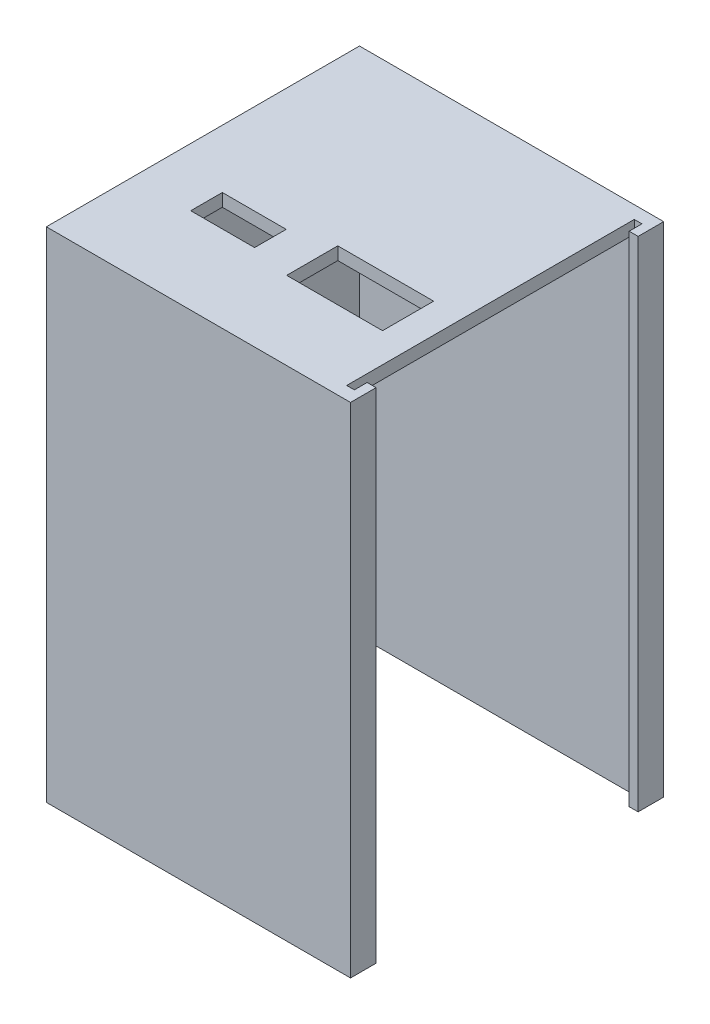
ISO-10303-21;
HEADER;
FILE_DESCRIPTION(('STEP AP214'),'2;1');
FILE_NAME('part.step','',(''),(''),'','','');
FILE_SCHEMA(('AUTOMOTIVE_DESIGN { 1 0 10303 214 1 1 1 1 }'));
ENDSEC;
DATA;
#1=APPLICATION_CONTEXT('core data for automotive mechanical design processes');
#2=APPLICATION_PROTOCOL_DEFINITION('international standard','automotive_design',2000,#1);
#3=PRODUCT_CONTEXT('',#1,'mechanical');
#4=PRODUCT('Part','Part','',(#3));
#5=PRODUCT_RELATED_PRODUCT_CATEGORY('part','',(#4));
#6=PRODUCT_DEFINITION_FORMATION('','',#4);
#7=PRODUCT_DEFINITION_CONTEXT('part definition',#1,'design');
#8=PRODUCT_DEFINITION('design','',#6,#7);
#9=PRODUCT_DEFINITION_SHAPE('','',#8);
#10=(LENGTH_UNIT() NAMED_UNIT(*) SI_UNIT(.MILLI.,.METRE.));
#11=(NAMED_UNIT(*) PLANE_ANGLE_UNIT() SI_UNIT($,.RADIAN.));
#12=(NAMED_UNIT(*) SI_UNIT($,.STERADIAN.) SOLID_ANGLE_UNIT());
#13=UNCERTAINTY_MEASURE_WITH_UNIT(LENGTH_MEASURE(1.E-05),#10,'distance_accuracy_value','');
#14=(GEOMETRIC_REPRESENTATION_CONTEXT(3) GLOBAL_UNCERTAINTY_ASSIGNED_CONTEXT((#13)) GLOBAL_UNIT_ASSIGNED_CONTEXT((#10,
#11,#12)) REPRESENTATION_CONTEXT('',''));
#15=CARTESIAN_POINT('',(0.,0.,0.));
#16=DIRECTION('',(0.,0.,1.));
#17=DIRECTION('',(1.,0.,0.));
#18=AXIS2_PLACEMENT_3D('',#15,#16,#17);
#19=CARTESIAN_POINT('',(22.7,-78.,-24.5));
#20=DIRECTION('',(1.,0.,0.));
#21=DIRECTION('',(0.,0.,-1.));
#22=AXIS2_PLACEMENT_3D('',#19,#20,#21);
#23=PLANE('',#22);
#24=DIRECTION('',(0.,1.,0.));
#25=VECTOR('',#24,1.);
#26=CARTESIAN_POINT('',(22.7,-78.,-24.5));
#27=LINE('',#26,#25);
#28=CARTESIAN_POINT('',(22.7,-78.,-24.5));
#29=VERTEX_POINT('',#28);
#30=CARTESIAN_POINT('',(22.7,-77.9884535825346,-24.5));
#31=VERTEX_POINT('',#30);
#32=EDGE_CURVE('E56',#29,#31,#27,.T.);
#33=ORIENTED_EDGE('',*,*,#32,.T.);
#34=DIRECTION('',(0.,0.,-1.));
#35=VECTOR('',#34,1.);
#36=CARTESIAN_POINT('',(22.7,-77.9884535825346,-24.5));
#37=LINE('',#36,#35);
#38=CARTESIAN_POINT('',(22.7,-77.9884535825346,-22.5));
#39=VERTEX_POINT('',#38);
#40=EDGE_CURVE('E51',#39,#31,#37,.T.);
#41=ORIENTED_EDGE('',*,*,#40,.F.);
#42=DIRECTION('',(0.,1.,0.));
#43=VECTOR('',#42,1.);
#44=CARTESIAN_POINT('',(22.7,-78.,-22.5));
#45=LINE('',#44,#43);
#46=CARTESIAN_POINT('',(22.7,-78.,-22.5));
#47=VERTEX_POINT('',#46);
#48=EDGE_CURVE('E293',#47,#39,#45,.T.);
#49=ORIENTED_EDGE('',*,*,#48,.F.);
#50=DIRECTION('',(0.,0.,-1.));
#51=VECTOR('',#50,1.);
#52=CARTESIAN_POINT('',(22.7,-78.,-24.5));
#53=LINE('',#52,#51);
#54=EDGE_CURVE('E272',#47,#29,#53,.T.);
#55=ORIENTED_EDGE('',*,*,#54,.T.);
#56=EDGE_LOOP('',(#33,#41,#49,#55));
#57=FACE_BOUND('',#56,.T.);
#58=ADVANCED_FACE('F35',(#57),#23,.T.);
#59=CARTESIAN_POINT('',(21.5,-2.,-22.5));
#60=DIRECTION('',(1.,0.,0.));
#61=DIRECTION('',(0.,0.,-1.));
#62=AXIS2_PLACEMENT_3D('',#59,#60,#61);
#63=PLANE('',#62);
#64=DIRECTION('',(0.,0.,-1.));
#65=VECTOR('',#64,1.);
#66=CARTESIAN_POINT('',(21.5,0.,-22.5));
#67=LINE('',#66,#65);
#68=CARTESIAN_POINT('',(21.5,0.,22.5));
#69=VERTEX_POINT('',#68);
#70=CARTESIAN_POINT('',(21.5,0.,-22.5));
#71=VERTEX_POINT('',#70);
#72=EDGE_CURVE('E361',#69,#71,#67,.T.);
#73=ORIENTED_EDGE('',*,*,#72,.F.);
#74=DIRECTION('',(0.,1.,0.));
#75=VECTOR('',#74,1.);
#76=CARTESIAN_POINT('',(21.5,-2.,22.5));
#77=LINE('',#76,#75);
#78=CARTESIAN_POINT('',(21.5,-2.,22.5));
#79=VERTEX_POINT('',#78);
#80=EDGE_CURVE('E11',#79,#69,#77,.T.);
#81=ORIENTED_EDGE('',*,*,#80,.F.);
#82=DIRECTION('',(0.,0.,-1.));
#83=VECTOR('',#82,1.);
#84=CARTESIAN_POINT('',(21.5,-2.,-22.5));
#85=LINE('',#84,#83);
#86=CARTESIAN_POINT('',(21.5,-2.,-22.5));
#87=VERTEX_POINT('',#86);
#88=EDGE_CURVE('E368',#79,#87,#85,.T.);
#89=ORIENTED_EDGE('',*,*,#88,.T.);
#90=DIRECTION('',(0.,1.,0.));
#91=VECTOR('',#90,1.);
#92=CARTESIAN_POINT('',(21.5,-2.,-22.5));
#93=LINE('',#92,#91);
#94=EDGE_CURVE('E44',#87,#71,#93,.T.);
#95=ORIENTED_EDGE('',*,*,#94,.T.);
#96=EDGE_LOOP('',(#73,#81,#89,#95));
#97=FACE_BOUND('',#96,.T.);
#98=ADVANCED_FACE('F37',(#97),#63,.T.);
#99=CARTESIAN_POINT('',(0.,-2.,0.));
#100=DIRECTION('',(0.,1.,0.));
#101=DIRECTION('',(0.,0.,1.));
#102=AXIS2_PLACEMENT_3D('',#99,#100,#101);
#103=PLANE('',#102);
#104=DIRECTION('',(0.,0.,-1.));
#105=VECTOR('',#104,1.);
#106=CARTESIAN_POINT('',(-14.3796285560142,-2.,6.08096368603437));
#107=LINE('',#106,#105);
#108=CARTESIAN_POINT('',(-14.3796285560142,-2.,11.0244015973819));
#109=VERTEX_POINT('',#108);
#110=CARTESIAN_POINT('',(-14.3796285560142,-2.,6.08096368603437));
#111=VERTEX_POINT('',#110);
#112=EDGE_CURVE('E301',#109,#111,#107,.T.);
#113=ORIENTED_EDGE('',*,*,#112,.F.);
#114=DIRECTION('',(-1.,0.,0.));
#115=VECTOR('',#114,1.);
#116=CARTESIAN_POINT('',(-4.38727623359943,-2.,11.0244015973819));
#117=LINE('',#116,#115);
#118=CARTESIAN_POINT('',(-4.38727623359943,-2.,11.0244015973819));
#119=VERTEX_POINT('',#118);
#120=EDGE_CURVE('E308',#119,#109,#117,.T.);
#121=ORIENTED_EDGE('',*,*,#120,.F.);
#122=DIRECTION('',(0.,0.,1.));
#123=VECTOR('',#122,1.);
#124=CARTESIAN_POINT('',(-4.38727623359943,-2.,10.4719816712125));
#125=LINE('',#124,#123);
#126=CARTESIAN_POINT('',(-4.38727623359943,-2.,6.08096368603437));
#127=VERTEX_POINT('',#126);
#128=EDGE_CURVE('E323',#127,#119,#125,.T.);
#129=ORIENTED_EDGE('',*,*,#128,.F.);
#130=DIRECTION('',(1.,0.,0.));
#131=VECTOR('',#130,1.);
#132=CARTESIAN_POINT('',(-4.38727623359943,-2.,6.08096368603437));
#133=LINE('',#132,#131);
#134=EDGE_CURVE('E320',#111,#127,#133,.T.);
#135=ORIENTED_EDGE('',*,*,#134,.F.);
#136=EDGE_LOOP('',(#113,#121,#129,#135));
#137=FACE_BOUND('',#136,.T.);
#138=DIRECTION('',(1.,0.,0.));
#139=VECTOR('',#138,1.);
#140=CARTESIAN_POINT('',(16.8834523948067,-2.,4.27647267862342));
#141=LINE('',#140,#139);
#142=CARTESIAN_POINT('',(1.88345239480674,-2.,4.27647267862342));
#143=VERTEX_POINT('',#142);
#144=CARTESIAN_POINT('',(16.8834523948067,-2.,4.27647267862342));
#145=VERTEX_POINT('',#144);
#146=EDGE_CURVE('E351',#143,#145,#141,.T.);
#147=ORIENTED_EDGE('',*,*,#146,.F.);
#148=DIRECTION('',(0.,0.,-1.));
#149=VECTOR('',#148,1.);
#150=CARTESIAN_POINT('',(1.88345239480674,-2.,4.27647267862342));
#151=LINE('',#150,#149);
#152=CARTESIAN_POINT('',(1.88345239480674,-2.,12.2764726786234));
#153=VERTEX_POINT('',#152);
#154=EDGE_CURVE('E330',#153,#143,#151,.T.);
#155=ORIENTED_EDGE('',*,*,#154,.F.);
#156=DIRECTION('',(-1.,0.,0.));
#157=VECTOR('',#156,1.);
#158=CARTESIAN_POINT('',(16.8834523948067,-2.,12.2764726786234));
#159=LINE('',#158,#157);
#160=CARTESIAN_POINT('',(16.8834523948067,-2.,12.2764726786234));
#161=VERTEX_POINT('',#160);
#162=EDGE_CURVE('E340',#161,#153,#159,.T.);
#163=ORIENTED_EDGE('',*,*,#162,.F.);
#164=DIRECTION('',(0.,0.,1.));
#165=VECTOR('',#164,1.);
#166=CARTESIAN_POINT('',(16.8834523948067,-2.,4.27647267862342));
#167=LINE('',#166,#165);
#168=EDGE_CURVE('E354',#145,#161,#167,.T.);
#169=ORIENTED_EDGE('',*,*,#168,.F.);
#170=EDGE_LOOP('',(#147,#155,#163,#169));
#171=FACE_BOUND('',#170,.T.);
#172=ORIENTED_EDGE('',*,*,#88,.F.);
#173=DIRECTION('',(1.,0.,0.));
#174=VECTOR('',#173,1.);
#175=CARTESIAN_POINT('',(-21.5,-2.,22.5));
#176=LINE('',#175,#174);
#177=CARTESIAN_POINT('',(-21.5,-2.,22.5));
#178=VERTEX_POINT('',#177);
#179=EDGE_CURVE('E380',#178,#79,#176,.T.);
#180=ORIENTED_EDGE('',*,*,#179,.F.);
#181=DIRECTION('',(0.,0.,1.));
#182=VECTOR('',#181,1.);
#183=CARTESIAN_POINT('',(-21.5,-2.,-22.5));
#184=LINE('',#183,#182);
#185=CARTESIAN_POINT('',(-21.5,-2.,-22.5));
#186=VERTEX_POINT('',#185);
#187=EDGE_CURVE('E376',#186,#178,#184,.T.);
#188=ORIENTED_EDGE('',*,*,#187,.F.);
#189=DIRECTION('',(-1.,0.,0.));
#190=VECTOR('',#189,1.);
#191=CARTESIAN_POINT('',(-21.5,-2.,-22.5));
#192=LINE('',#191,#190);
#193=EDGE_CURVE('E371',#87,#186,#192,.T.);
#194=ORIENTED_EDGE('',*,*,#193,.F.);
#195=EDGE_LOOP('',(#172,#180,#188,#194));
#196=FACE_BOUND('',#195,.T.);
#197=ADVANCED_FACE('F400',(#137,#171,#196),#103,.F.);
#198=CARTESIAN_POINT('',(0.,0.,0.));
#199=DIRECTION('',(0.,1.,0.));
#200=DIRECTION('',(0.,0.,1.));
#201=AXIS2_PLACEMENT_3D('',#198,#199,#200);
#202=PLANE('',#201);
#203=DIRECTION('',(-1.,0.,0.));
#204=VECTOR('',#203,1.);
#205=CARTESIAN_POINT('',(-4.38727623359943,0.,11.0244015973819));
#206=LINE('',#205,#204);
#207=CARTESIAN_POINT('',(-4.38727623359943,0.,11.0244015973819));
#208=VERTEX_POINT('',#207);
#209=CARTESIAN_POINT('',(-14.3796285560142,0.,11.0244015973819));
#210=VERTEX_POINT('',#209);
#211=EDGE_CURVE('E314',#208,#210,#206,.T.);
#212=ORIENTED_EDGE('',*,*,#211,.T.);
#213=DIRECTION('',(0.,0.,-1.));
#214=VECTOR('',#213,1.);
#215=CARTESIAN_POINT('',(-14.3796285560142,0.,11.0244015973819));
#216=LINE('',#215,#214);
#217=CARTESIAN_POINT('',(-14.3796285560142,0.,6.08096368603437));
#218=VERTEX_POINT('',#217);
#219=EDGE_CURVE('E304',#210,#218,#216,.T.);
#220=ORIENTED_EDGE('',*,*,#219,.T.);
#221=DIRECTION('',(1.,0.,0.));
#222=VECTOR('',#221,1.);
#223=CARTESIAN_POINT('',(-4.38727623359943,0.,6.08096368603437));
#224=LINE('',#223,#222);
#225=CARTESIAN_POINT('',(-4.38727623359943,0.,6.08096368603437));
#226=VERTEX_POINT('',#225);
#227=EDGE_CURVE('E307',#218,#226,#224,.T.);
#228=ORIENTED_EDGE('',*,*,#227,.T.);
#229=DIRECTION('',(0.,0.,1.));
#230=VECTOR('',#229,1.);
#231=CARTESIAN_POINT('',(-4.38727623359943,0.,6.08096368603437));
#232=LINE('',#231,#230);
#233=EDGE_CURVE('E311',#226,#208,#232,.T.);
#234=ORIENTED_EDGE('',*,*,#233,.T.);
#235=EDGE_LOOP('',(#212,#220,#228,#234));
#236=FACE_BOUND('',#235,.T.);
#237=DIRECTION('',(0.,0.,-1.));
#238=VECTOR('',#237,1.);
#239=CARTESIAN_POINT('',(1.88345239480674,0.,4.27647267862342));
#240=LINE('',#239,#238);
#241=CARTESIAN_POINT('',(1.88345239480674,0.,12.2764726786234));
#242=VERTEX_POINT('',#241);
#243=CARTESIAN_POINT('',(1.88345239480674,0.,4.27647267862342));
#244=VERTEX_POINT('',#243);
#245=EDGE_CURVE('E336',#242,#244,#240,.T.);
#246=ORIENTED_EDGE('',*,*,#245,.T.);
#247=DIRECTION('',(1.,0.,0.));
#248=VECTOR('',#247,1.);
#249=CARTESIAN_POINT('',(16.8834523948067,0.,4.27647267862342));
#250=LINE('',#249,#248);
#251=CARTESIAN_POINT('',(16.8834523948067,0.,4.27647267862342));
#252=VERTEX_POINT('',#251);
#253=EDGE_CURVE('E339',#244,#252,#250,.T.);
#254=ORIENTED_EDGE('',*,*,#253,.T.);
#255=DIRECTION('',(0.,0.,1.));
#256=VECTOR('',#255,1.);
#257=CARTESIAN_POINT('',(16.8834523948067,0.,4.27647267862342));
#258=LINE('',#257,#256);
#259=CARTESIAN_POINT('',(16.8834523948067,0.,12.2764726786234));
#260=VERTEX_POINT('',#259);
#261=EDGE_CURVE('E343',#252,#260,#258,.T.);
#262=ORIENTED_EDGE('',*,*,#261,.T.);
#263=DIRECTION('',(-1.,0.,0.));
#264=VECTOR('',#263,1.);
#265=CARTESIAN_POINT('',(16.8834523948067,0.,12.2764726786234));
#266=LINE('',#265,#264);
#267=EDGE_CURVE('E346',#260,#242,#266,.T.);
#268=ORIENTED_EDGE('',*,*,#267,.T.);
#269=EDGE_LOOP('',(#246,#254,#262,#268));
#270=FACE_BOUND('',#269,.T.);
#271=ORIENTED_EDGE('',*,*,#72,.T.);
#272=DIRECTION('',(1.,0.,0.));
#273=VECTOR('',#272,1.);
#274=CARTESIAN_POINT('',(-23.5,0.,-22.5));
#275=LINE('',#274,#273);
#276=CARTESIAN_POINT('',(22.7,0.,-22.5));
#277=VERTEX_POINT('',#276);
#278=EDGE_CURVE('E275',#71,#277,#275,.T.);
#279=ORIENTED_EDGE('',*,*,#278,.T.);
#280=DIRECTION('',(0.,0.,1.));
#281=VECTOR('',#280,1.);
#282=CARTESIAN_POINT('',(22.7,0.,-24.5));
#283=LINE('',#282,#281);
#284=CARTESIAN_POINT('',(22.7,0.,-20.5));
#285=VERTEX_POINT('',#284);
#286=EDGE_CURVE('E235',#277,#285,#283,.T.);
#287=ORIENTED_EDGE('',*,*,#286,.T.);
#288=DIRECTION('',(-1.,0.,0.));
#289=VECTOR('',#288,1.);
#290=CARTESIAN_POINT('',(24.1,0.,-20.5));
#291=LINE('',#290,#289);
#292=CARTESIAN_POINT('',(24.1,0.,-20.5));
#293=VERTEX_POINT('',#292);
#294=EDGE_CURVE('E257',#293,#285,#291,.T.);
#295=ORIENTED_EDGE('',*,*,#294,.F.);
#296=DIRECTION('',(0.,0.,1.));
#297=VECTOR('',#296,1.);
#298=CARTESIAN_POINT('',(24.1,0.,-24.5));
#299=LINE('',#298,#297);
#300=CARTESIAN_POINT('',(24.1,0.,-24.5));
#301=VERTEX_POINT('',#300);
#302=EDGE_CURVE('E239',#301,#293,#299,.T.);
#303=ORIENTED_EDGE('',*,*,#302,.F.);
#304=DIRECTION('',(-1.,0.,0.));
#305=VECTOR('',#304,1.);
#306=CARTESIAN_POINT('',(-23.5,0.,-24.5));
#307=LINE('',#306,#305);
#308=CARTESIAN_POINT('',(-23.5,0.,-24.5));
#309=VERTEX_POINT('',#308);
#310=EDGE_CURVE('E281',#301,#309,#307,.T.);
#311=ORIENTED_EDGE('',*,*,#310,.T.);
#312=DIRECTION('',(0.,0.,1.));
#313=VECTOR('',#312,1.);
#314=CARTESIAN_POINT('',(-23.5,0.,22.5));
#315=LINE('',#314,#313);
#316=CARTESIAN_POINT('',(-23.5,0.,24.5));
#317=VERTEX_POINT('',#316);
#318=EDGE_CURVE('E291',#309,#317,#315,.T.);
#319=ORIENTED_EDGE('',*,*,#318,.T.);
#320=DIRECTION('',(1.,0.,0.));
#321=VECTOR('',#320,1.);
#322=CARTESIAN_POINT('',(22.7,0.,24.5));
#323=LINE('',#322,#321);
#324=CARTESIAN_POINT('',(24.1,0.,24.5));
#325=VERTEX_POINT('',#324);
#326=EDGE_CURVE('E270',#317,#325,#323,.T.);
#327=ORIENTED_EDGE('',*,*,#326,.T.);
#328=DIRECTION('',(0.,0.,1.));
#329=VECTOR('',#328,1.);
#330=CARTESIAN_POINT('',(24.1,0.,24.5));
#331=LINE('',#330,#329);
#332=CARTESIAN_POINT('',(24.1,0.,20.5));
#333=VERTEX_POINT('',#332);
#334=EDGE_CURVE('E219',#333,#325,#331,.T.);
#335=ORIENTED_EDGE('',*,*,#334,.F.);
#336=DIRECTION('',(-1.,0.,0.));
#337=VECTOR('',#336,1.);
#338=CARTESIAN_POINT('',(24.1,0.,20.5));
#339=LINE('',#338,#337);
#340=CARTESIAN_POINT('',(22.7,0.,20.5));
#341=VERTEX_POINT('',#340);
#342=EDGE_CURVE('E228',#333,#341,#339,.T.);
#343=ORIENTED_EDGE('',*,*,#342,.T.);
#344=DIRECTION('',(0.,0.,1.));
#345=VECTOR('',#344,1.);
#346=CARTESIAN_POINT('',(22.7,0.,24.5));
#347=LINE('',#346,#345);
#348=CARTESIAN_POINT('',(22.7,0.,22.5));
#349=VERTEX_POINT('',#348);
#350=EDGE_CURVE('E220',#341,#349,#347,.T.);
#351=ORIENTED_EDGE('',*,*,#350,.T.);
#352=DIRECTION('',(-1.,0.,0.));
#353=VECTOR('',#352,1.);
#354=CARTESIAN_POINT('',(22.7,0.,22.5));
#355=LINE('',#354,#353);
#356=EDGE_CURVE('E263',#349,#69,#355,.T.);
#357=ORIENTED_EDGE('',*,*,#356,.T.);
#358=EDGE_LOOP('',(#271,#279,#287,#295,#303,#311,#319,#327,#335,#343,#351,#357));
#359=FACE_BOUND('',#358,.T.);
#360=ADVANCED_FACE('F424',(#236,#270,#359),#202,.T.);
#361=CARTESIAN_POINT('',(1.88345239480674,0.,4.27647267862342));
#362=DIRECTION('',(-1.,0.,0.));
#363=DIRECTION('',(0.,0.,1.));
#364=AXIS2_PLACEMENT_3D('',#361,#362,#363);
#365=PLANE('',#364);
#366=ORIENTED_EDGE('',*,*,#154,.T.);
#367=DIRECTION('',(0.,-1.,0.));
#368=VECTOR('',#367,1.);
#369=CARTESIAN_POINT('',(1.88345239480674,0.,4.27647267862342));
#370=LINE('',#369,#368);
#371=EDGE_CURVE('E349',#244,#143,#370,.T.);
#372=ORIENTED_EDGE('',*,*,#371,.F.);
#373=ORIENTED_EDGE('',*,*,#245,.F.);
#374=DIRECTION('',(0.,-1.,0.));
#375=VECTOR('',#374,1.);
#376=CARTESIAN_POINT('',(1.88345239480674,0.,12.2764726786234));
#377=LINE('',#376,#375);
#378=EDGE_CURVE('E359',#242,#153,#377,.T.);
#379=ORIENTED_EDGE('',*,*,#378,.T.);
#380=EDGE_LOOP('',(#366,#372,#373,#379));
#381=FACE_BOUND('',#380,.T.);
#382=ADVANCED_FACE('F489',(#381),#365,.F.);
#383=CARTESIAN_POINT('',(16.8834523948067,0.,12.2764726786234));
#384=DIRECTION('',(0.,0.,1.));
#385=DIRECTION('',(1.,0.,0.));
#386=AXIS2_PLACEMENT_3D('',#383,#384,#385);
#387=PLANE('',#386);
#388=ORIENTED_EDGE('',*,*,#162,.T.);
#389=ORIENTED_EDGE('',*,*,#378,.F.);
#390=ORIENTED_EDGE('',*,*,#267,.F.);
#391=DIRECTION('',(0.,-1.,0.));
#392=VECTOR('',#391,1.);
#393=CARTESIAN_POINT('',(16.8834523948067,0.,12.2764726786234));
#394=LINE('',#393,#392);
#395=EDGE_CURVE('E362',#260,#161,#394,.T.);
#396=ORIENTED_EDGE('',*,*,#395,.T.);
#397=EDGE_LOOP('',(#388,#389,#390,#396));
#398=FACE_BOUND('',#397,.T.);
#399=ADVANCED_FACE('F485',(#398),#387,.F.);
#400=CARTESIAN_POINT('',(16.8834523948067,0.,4.27647267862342));
#401=DIRECTION('',(1.,0.,0.));
#402=DIRECTION('',(0.,0.,-1.));
#403=AXIS2_PLACEMENT_3D('',#400,#401,#402);
#404=PLANE('',#403);
#405=ORIENTED_EDGE('',*,*,#168,.T.);
#406=ORIENTED_EDGE('',*,*,#395,.F.);
#407=ORIENTED_EDGE('',*,*,#261,.F.);
#408=DIRECTION('',(0.,-1.,0.));
#409=VECTOR('',#408,1.);
#410=CARTESIAN_POINT('',(16.8834523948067,0.,4.27647267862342));
#411=LINE('',#410,#409);
#412=EDGE_CURVE('E364',#252,#145,#411,.T.);
#413=ORIENTED_EDGE('',*,*,#412,.T.);
#414=EDGE_LOOP('',(#405,#406,#407,#413));
#415=FACE_BOUND('',#414,.T.);
#416=ADVANCED_FACE('F488',(#415),#404,.F.);
#417=CARTESIAN_POINT('',(16.8834523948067,0.,4.27647267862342));
#418=DIRECTION('',(0.,0.,-1.));
#419=DIRECTION('',(-1.,0.,0.));
#420=AXIS2_PLACEMENT_3D('',#417,#418,#419);
#421=PLANE('',#420);
#422=ORIENTED_EDGE('',*,*,#146,.T.);
#423=ORIENTED_EDGE('',*,*,#412,.F.);
#424=ORIENTED_EDGE('',*,*,#253,.F.);
#425=ORIENTED_EDGE('',*,*,#371,.T.);
#426=EDGE_LOOP('',(#422,#423,#424,#425));
#427=FACE_BOUND('',#426,.T.);
#428=ADVANCED_FACE('F473',(#427),#421,.F.);
#429=CARTESIAN_POINT('',(-4.38727623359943,0.,11.0244015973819));
#430=DIRECTION('',(0.,0.,1.));
#431=DIRECTION('',(1.,0.,0.));
#432=AXIS2_PLACEMENT_3D('',#429,#430,#431);
#433=PLANE('',#432);
#434=ORIENTED_EDGE('',*,*,#120,.T.);
#435=DIRECTION('',(0.,-1.,0.));
#436=VECTOR('',#435,1.);
#437=CARTESIAN_POINT('',(-14.3796285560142,0.,11.0244015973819));
#438=LINE('',#437,#436);
#439=EDGE_CURVE('E327',#210,#109,#438,.T.);
#440=ORIENTED_EDGE('',*,*,#439,.F.);
#441=ORIENTED_EDGE('',*,*,#211,.F.);
#442=DIRECTION('',(0.,-1.,0.));
#443=VECTOR('',#442,1.);
#444=CARTESIAN_POINT('',(-4.38727623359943,0.,11.0244015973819));
#445=LINE('',#444,#443);
#446=EDGE_CURVE('E331',#208,#119,#445,.T.);
#447=ORIENTED_EDGE('',*,*,#446,.T.);
#448=EDGE_LOOP('',(#434,#440,#441,#447));
#449=FACE_BOUND('',#448,.T.);
#450=ADVANCED_FACE('F469',(#449),#433,.F.);
#451=CARTESIAN_POINT('',(-4.38727623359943,0.,10.4719816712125));
#452=DIRECTION('',(1.,0.,0.));
#453=DIRECTION('',(0.,0.,-1.));
#454=AXIS2_PLACEMENT_3D('',#451,#452,#453);
#455=PLANE('',#454);
#456=ORIENTED_EDGE('',*,*,#128,.T.);
#457=ORIENTED_EDGE('',*,*,#446,.F.);
#458=ORIENTED_EDGE('',*,*,#233,.F.);
#459=DIRECTION('',(0.,-1.,0.));
#460=VECTOR('',#459,1.);
#461=CARTESIAN_POINT('',(-4.38727623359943,0.,6.08096368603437));
#462=LINE('',#461,#460);
#463=EDGE_CURVE('E333',#226,#127,#462,.T.);
#464=ORIENTED_EDGE('',*,*,#463,.T.);
#465=EDGE_LOOP('',(#456,#457,#458,#464));
#466=FACE_BOUND('',#465,.T.);
#467=ADVANCED_FACE('F472',(#466),#455,.F.);
#468=CARTESIAN_POINT('',(-4.38727623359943,0.,6.08096368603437));
#469=DIRECTION('',(0.,0.,-1.));
#470=DIRECTION('',(-1.,0.,0.));
#471=AXIS2_PLACEMENT_3D('',#468,#469,#470);
#472=PLANE('',#471);
#473=ORIENTED_EDGE('',*,*,#134,.T.);
#474=ORIENTED_EDGE('',*,*,#463,.F.);
#475=ORIENTED_EDGE('',*,*,#227,.F.);
#476=DIRECTION('',(0.,-1.,0.));
#477=VECTOR('',#476,1.);
#478=CARTESIAN_POINT('',(-14.3796285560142,0.,6.08096368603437));
#479=LINE('',#478,#477);
#480=EDGE_CURVE('E317',#218,#111,#479,.T.);
#481=ORIENTED_EDGE('',*,*,#480,.T.);
#482=EDGE_LOOP('',(#473,#474,#475,#481));
#483=FACE_BOUND('',#482,.T.);
#484=ADVANCED_FACE('F477',(#483),#472,.F.);
#485=CARTESIAN_POINT('',(-14.3796285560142,0.,6.08096368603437));
#486=DIRECTION('',(-1.,0.,0.));
#487=DIRECTION('',(0.,0.,1.));
#488=AXIS2_PLACEMENT_3D('',#485,#486,#487);
#489=PLANE('',#488);
#490=ORIENTED_EDGE('',*,*,#112,.T.);
#491=ORIENTED_EDGE('',*,*,#480,.F.);
#492=ORIENTED_EDGE('',*,*,#219,.F.);
#493=ORIENTED_EDGE('',*,*,#439,.T.);
#494=EDGE_LOOP('',(#490,#491,#492,#493));
#495=FACE_BOUND('',#494,.T.);
#496=ADVANCED_FACE('F468',(#495),#489,.F.);
#497=CARTESIAN_POINT('',(-21.5,-78.,22.5));
#498=DIRECTION('',(1.,0.,0.));
#499=DIRECTION('',(0.,0.,-1.));
#500=AXIS2_PLACEMENT_3D('',#497,#498,#499);
#501=PLANE('',#500);
#502=DIRECTION('',(0.,1.,0.));
#503=VECTOR('',#502,1.);
#504=CARTESIAN_POINT('',(-21.5,-78.,-22.5));
#505=LINE('',#504,#503);
#506=CARTESIAN_POINT('',(-21.5,-78.,-22.5));
#507=VERTEX_POINT('',#506);
#508=EDGE_CURVE('E289',#507,#186,#505,.T.);
#509=ORIENTED_EDGE('',*,*,#508,.T.);
#510=ORIENTED_EDGE('',*,*,#187,.T.);
#511=DIRECTION('',(0.,1.,0.));
#512=VECTOR('',#511,1.);
#513=CARTESIAN_POINT('',(-21.5,-78.,22.5));
#514=LINE('',#513,#512);
#515=CARTESIAN_POINT('',(-21.5,-78.,22.5));
#516=VERTEX_POINT('',#515);
#517=EDGE_CURVE('E298',#516,#178,#514,.T.);
#518=ORIENTED_EDGE('',*,*,#517,.F.);
#519=DIRECTION('',(0.,0.,-1.));
#520=VECTOR('',#519,1.);
#521=CARTESIAN_POINT('',(-21.5,-78.,22.5));
#522=LINE('',#521,#520);
#523=EDGE_CURVE('E290',#516,#507,#522,.T.);
#524=ORIENTED_EDGE('',*,*,#523,.T.);
#525=EDGE_LOOP('',(#509,#510,#518,#524));
#526=FACE_BOUND('',#525,.T.);
#527=ADVANCED_FACE('F403',(#526),#501,.T.);
#528=CARTESIAN_POINT('',(-23.5,-78.,22.5));
#529=DIRECTION('',(-1.,0.,0.));
#530=DIRECTION('',(0.,0.,1.));
#531=AXIS2_PLACEMENT_3D('',#528,#529,#530);
#532=PLANE('',#531);
#533=ORIENTED_EDGE('',*,*,#318,.F.);
#534=DIRECTION('',(0.,1.,0.));
#535=VECTOR('',#534,1.);
#536=CARTESIAN_POINT('',(-23.5,-78.,-24.5));
#537=LINE('',#536,#535);
#538=CARTESIAN_POINT('',(-23.5,-78.,-24.5));
#539=VERTEX_POINT('',#538);
#540=EDGE_CURVE('E410',#539,#309,#537,.T.);
#541=ORIENTED_EDGE('',*,*,#540,.F.);
#542=DIRECTION('',(0.,0.,1.));
#543=VECTOR('',#542,1.);
#544=CARTESIAN_POINT('',(-23.5,-78.,22.5));
#545=LINE('',#544,#543);
#546=CARTESIAN_POINT('',(-23.5,-78.,24.5));
#547=VERTEX_POINT('',#546);
#548=EDGE_CURVE('E287',#539,#547,#545,.T.);
#549=ORIENTED_EDGE('',*,*,#548,.T.);
#550=DIRECTION('',(0.,1.,0.));
#551=VECTOR('',#550,1.);
#552=CARTESIAN_POINT('',(-23.5,-78.,24.5));
#553=LINE('',#552,#551);
#554=EDGE_CURVE('E201',#547,#317,#553,.T.);
#555=ORIENTED_EDGE('',*,*,#554,.T.);
#556=EDGE_LOOP('',(#533,#541,#549,#555));
#557=FACE_BOUND('',#556,.T.);
#558=ADVANCED_FACE('F463',(#557),#532,.T.);
#559=CARTESIAN_POINT('',(0.,-78.,0.));
#560=DIRECTION('',(0.,-1.,0.));
#561=DIRECTION('',(0.,0.,-1.));
#562=AXIS2_PLACEMENT_3D('',#559,#560,#561);
#563=PLANE('',#562);
#564=ORIENTED_EDGE('',*,*,#523,.F.);
#565=DIRECTION('',(-1.,0.,0.));
#566=VECTOR('',#565,1.);
#567=CARTESIAN_POINT('',(22.7,-78.,22.5));
#568=LINE('',#567,#566);
#569=CARTESIAN_POINT('',(22.7,-78.,22.5));
#570=VERTEX_POINT('',#569);
#571=EDGE_CURVE('E204',#570,#516,#568,.T.);
#572=ORIENTED_EDGE('',*,*,#571,.F.);
#573=DIRECTION('',(0.,0.,-1.));
#574=VECTOR('',#573,1.);
#575=CARTESIAN_POINT('',(22.7,-78.,24.5));
#576=LINE('',#575,#574);
#577=CARTESIAN_POINT('',(22.7,-78.,20.5));
#578=VERTEX_POINT('',#577);
#579=EDGE_CURVE('E229',#570,#578,#576,.T.);
#580=ORIENTED_EDGE('',*,*,#579,.T.);
#581=DIRECTION('',(-1.,0.,0.));
#582=VECTOR('',#581,1.);
#583=CARTESIAN_POINT('',(24.1,-78.,20.5));
#584=LINE('',#583,#582);
#585=CARTESIAN_POINT('',(24.1,-78.,20.5));
#586=VERTEX_POINT('',#585);
#587=EDGE_CURVE('E211',#586,#578,#584,.T.);
#588=ORIENTED_EDGE('',*,*,#587,.F.);
#589=DIRECTION('',(0.,0.,-1.));
#590=VECTOR('',#589,1.);
#591=CARTESIAN_POINT('',(24.1,-78.,24.5));
#592=LINE('',#591,#590);
#593=CARTESIAN_POINT('',(24.1,-78.,24.5));
#594=VERTEX_POINT('',#593);
#595=EDGE_CURVE('E207',#594,#586,#592,.T.);
#596=ORIENTED_EDGE('',*,*,#595,.F.);
#597=DIRECTION('',(1.,0.,0.));
#598=VECTOR('',#597,1.);
#599=CARTESIAN_POINT('',(22.7,-78.,24.5));
#600=LINE('',#599,#598);
#601=EDGE_CURVE('E194',#547,#594,#600,.T.);
#602=ORIENTED_EDGE('',*,*,#601,.F.);
#603=ORIENTED_EDGE('',*,*,#548,.F.);
#604=DIRECTION('',(-1.,0.,0.));
#605=VECTOR('',#604,1.);
#606=CARTESIAN_POINT('',(-23.5,-78.,-24.5));
#607=LINE('',#606,#605);
#608=EDGE_CURVE('E274',#29,#539,#607,.T.);
#609=ORIENTED_EDGE('',*,*,#608,.F.);
#610=ORIENTED_EDGE('',*,*,#54,.F.);
#611=DIRECTION('',(1.,0.,0.));
#612=VECTOR('',#611,1.);
#613=CARTESIAN_POINT('',(-23.5,-78.,-22.5));
#614=LINE('',#613,#612);
#615=EDGE_CURVE('E278',#507,#47,#614,.T.);
#616=ORIENTED_EDGE('',*,*,#615,.F.);
#617=EDGE_LOOP('',(#564,#572,#580,#588,#596,#602,#603,#609,#610,#616));
#618=FACE_BOUND('',#617,.T.);
#619=ADVANCED_FACE('F209',(#618),#563,.T.);
#620=CARTESIAN_POINT('',(-23.5,-78.,-22.5));
#621=DIRECTION('',(0.,0.,1.));
#622=DIRECTION('',(1.,0.,0.));
#623=AXIS2_PLACEMENT_3D('',#620,#621,#622);
#624=PLANE('',#623);
#625=ORIENTED_EDGE('',*,*,#94,.F.);
#626=ORIENTED_EDGE('',*,*,#193,.T.);
#627=ORIENTED_EDGE('',*,*,#508,.F.);
#628=ORIENTED_EDGE('',*,*,#615,.T.);
#629=ORIENTED_EDGE('',*,*,#48,.T.);
#630=DIRECTION('',(0.,-1.,0.));
#631=VECTOR('',#630,1.);
#632=CARTESIAN_POINT('',(22.7,-78.,-22.5));
#633=LINE('',#632,#631);
#634=EDGE_CURVE('E260',#277,#39,#633,.T.);
#635=ORIENTED_EDGE('',*,*,#634,.F.);
#636=ORIENTED_EDGE('',*,*,#278,.F.);
#637=EDGE_LOOP('',(#625,#626,#627,#628,#629,#635,#636));
#638=FACE_BOUND('',#637,.T.);
#639=ADVANCED_FACE('F406',(#638),#624,.T.);
#640=CARTESIAN_POINT('',(-23.5,-78.,-24.5));
#641=DIRECTION('',(0.,0.,-1.));
#642=DIRECTION('',(-1.,0.,0.));
#643=AXIS2_PLACEMENT_3D('',#640,#641,#642);
#644=PLANE('',#643);
#645=ORIENTED_EDGE('',*,*,#310,.F.);
#646=DIRECTION('',(0.,1.,0.));
#647=VECTOR('',#646,1.);
#648=CARTESIAN_POINT('',(24.1,0.,-24.5));
#649=LINE('',#648,#647);
#650=CARTESIAN_POINT('',(24.1,-77.9884535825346,-24.5));
#651=VERTEX_POINT('',#650);
#652=EDGE_CURVE('E236',#651,#301,#649,.T.);
#653=ORIENTED_EDGE('',*,*,#652,.F.);
#654=DIRECTION('',(-1.,0.,0.));
#655=VECTOR('',#654,1.);
#656=CARTESIAN_POINT('',(24.1,-77.9884535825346,-24.5));
#657=LINE('',#656,#655);
#658=EDGE_CURVE('E246',#651,#31,#657,.T.);
#659=ORIENTED_EDGE('',*,*,#658,.T.);
#660=ORIENTED_EDGE('',*,*,#32,.F.);
#661=ORIENTED_EDGE('',*,*,#608,.T.);
#662=ORIENTED_EDGE('',*,*,#540,.T.);
#663=EDGE_LOOP('',(#645,#653,#659,#660,#661,#662));
#664=FACE_BOUND('',#663,.T.);
#665=ADVANCED_FACE('F418',(#664),#644,.T.);
#666=CARTESIAN_POINT('',(22.7,-78.,24.5));
#667=DIRECTION('',(0.,0.,1.));
#668=DIRECTION('',(1.,0.,0.));
#669=AXIS2_PLACEMENT_3D('',#666,#667,#668);
#670=PLANE('',#669);
#671=ORIENTED_EDGE('',*,*,#326,.F.);
#672=ORIENTED_EDGE('',*,*,#554,.F.);
#673=ORIENTED_EDGE('',*,*,#601,.T.);
#674=DIRECTION('',(0.,-1.,0.));
#675=VECTOR('',#674,1.);
#676=CARTESIAN_POINT('',(24.1,0.,24.5));
#677=LINE('',#676,#675);
#678=EDGE_CURVE('E199',#325,#594,#677,.T.);
#679=ORIENTED_EDGE('',*,*,#678,.F.);
#680=EDGE_LOOP('',(#671,#672,#673,#679));
#681=FACE_BOUND('',#680,.T.);
#682=ADVANCED_FACE('F197',(#681),#670,.T.);
#683=CARTESIAN_POINT('',(22.7,-78.,22.5));
#684=DIRECTION('',(0.,0.,-1.));
#685=DIRECTION('',(-1.,0.,0.));
#686=AXIS2_PLACEMENT_3D('',#683,#684,#685);
#687=PLANE('',#686);
#688=ORIENTED_EDGE('',*,*,#571,.T.);
#689=ORIENTED_EDGE('',*,*,#517,.T.);
#690=ORIENTED_EDGE('',*,*,#179,.T.);
#691=ORIENTED_EDGE('',*,*,#80,.T.);
#692=ORIENTED_EDGE('',*,*,#356,.F.);
#693=DIRECTION('',(0.,1.,0.));
#694=VECTOR('',#693,1.);
#695=CARTESIAN_POINT('',(22.7,-78.,22.5));
#696=LINE('',#695,#694);
#697=EDGE_CURVE('E203',#570,#349,#696,.T.);
#698=ORIENTED_EDGE('',*,*,#697,.F.);
#699=EDGE_LOOP('',(#688,#689,#690,#691,#692,#698));
#700=FACE_BOUND('',#699,.T.);
#701=ADVANCED_FACE('F395',(#700),#687,.T.);
#702=CARTESIAN_POINT('',(24.1,0.,-20.5));
#703=DIRECTION('',(0.,0.,-1.));
#704=DIRECTION('',(0.,1.,0.));
#705=AXIS2_PLACEMENT_3D('',#702,#703,#704);
#706=PLANE('',#705);
#707=DIRECTION('',(0.,-1.,0.));
#708=VECTOR('',#707,1.);
#709=CARTESIAN_POINT('',(22.7,0.,-20.5));
#710=LINE('',#709,#708);
#711=CARTESIAN_POINT('',(22.7,-77.9884535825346,-20.5));
#712=VERTEX_POINT('',#711);
#713=EDGE_CURVE('E248',#285,#712,#710,.T.);
#714=ORIENTED_EDGE('',*,*,#713,.T.);
#715=DIRECTION('',(-1.,0.,0.));
#716=VECTOR('',#715,1.);
#717=CARTESIAN_POINT('',(24.1,-77.9884535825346,-20.5));
#718=LINE('',#717,#716);
#719=CARTESIAN_POINT('',(24.1,-77.9884535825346,-20.5));
#720=VERTEX_POINT('',#719);
#721=EDGE_CURVE('E254',#720,#712,#718,.T.);
#722=ORIENTED_EDGE('',*,*,#721,.F.);
#723=DIRECTION('',(0.,-1.,0.));
#724=VECTOR('',#723,1.);
#725=CARTESIAN_POINT('',(24.1,0.,-20.5));
#726=LINE('',#725,#724);
#727=EDGE_CURVE('E242',#293,#720,#726,.T.);
#728=ORIENTED_EDGE('',*,*,#727,.F.);
#729=ORIENTED_EDGE('',*,*,#294,.T.);
#730=EDGE_LOOP('',(#714,#722,#728,#729));
#731=FACE_BOUND('',#730,.T.);
#732=ADVANCED_FACE('F595',(#731),#706,.F.);
#733=CARTESIAN_POINT('',(24.1,-77.9884535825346,-24.5));
#734=DIRECTION('',(0.,1.,0.));
#735=DIRECTION('',(0.,0.,1.));
#736=AXIS2_PLACEMENT_3D('',#733,#734,#735);
#737=PLANE('',#736);
#738=EDGE_CURVE('E240',#712,#39,#37,.T.);
#739=ORIENTED_EDGE('',*,*,#738,.T.);
#740=ORIENTED_EDGE('',*,*,#40,.T.);
#741=ORIENTED_EDGE('',*,*,#658,.F.);
#742=DIRECTION('',(0.,0.,-1.));
#743=VECTOR('',#742,1.);
#744=CARTESIAN_POINT('',(24.1,-77.9884535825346,-24.5));
#745=LINE('',#744,#743);
#746=EDGE_CURVE('E244',#720,#651,#745,.T.);
#747=ORIENTED_EDGE('',*,*,#746,.F.);
#748=ORIENTED_EDGE('',*,*,#721,.T.);
#749=EDGE_LOOP('',(#739,#740,#741,#747,#748));
#750=FACE_BOUND('',#749,.T.);
#751=ADVANCED_FACE('F601',(#750),#737,.F.);
#752=CARTESIAN_POINT('',(24.1,0.,0.));
#753=DIRECTION('',(-1.,0.,0.));
#754=DIRECTION('',(0.,0.,1.));
#755=AXIS2_PLACEMENT_3D('',#752,#753,#754);
#756=PLANE('',#755);
#757=ORIENTED_EDGE('',*,*,#652,.T.);
#758=ORIENTED_EDGE('',*,*,#302,.T.);
#759=ORIENTED_EDGE('',*,*,#727,.T.);
#760=ORIENTED_EDGE('',*,*,#746,.T.);
#761=EDGE_LOOP('',(#757,#758,#759,#760));
#762=FACE_BOUND('',#761,.T.);
#763=ADVANCED_FACE('F447',(#762),#756,.F.);
#764=CARTESIAN_POINT('',(22.7,0.,0.));
#765=DIRECTION('',(-1.,0.,0.));
#766=DIRECTION('',(0.,0.,1.));
#767=AXIS2_PLACEMENT_3D('',#764,#765,#766);
#768=PLANE('',#767);
#769=ORIENTED_EDGE('',*,*,#286,.F.);
#770=ORIENTED_EDGE('',*,*,#634,.T.);
#771=ORIENTED_EDGE('',*,*,#738,.F.);
#772=ORIENTED_EDGE('',*,*,#713,.F.);
#773=EDGE_LOOP('',(#769,#770,#771,#772));
#774=FACE_BOUND('',#773,.T.);
#775=ADVANCED_FACE('F440',(#774),#768,.T.);
#776=CARTESIAN_POINT('',(24.1,0.,20.5));
#777=DIRECTION('',(0.,0.,1.));
#778=DIRECTION('',(0.,-1.,0.));
#779=AXIS2_PLACEMENT_3D('',#776,#777,#778);
#780=PLANE('',#779);
#781=DIRECTION('',(0.,1.,0.));
#782=VECTOR('',#781,1.);
#783=CARTESIAN_POINT('',(22.7,0.,20.5));
#784=LINE('',#783,#782);
#785=EDGE_CURVE('E223',#578,#341,#784,.T.);
#786=ORIENTED_EDGE('',*,*,#785,.T.);
#787=ORIENTED_EDGE('',*,*,#342,.F.);
#788=DIRECTION('',(0.,1.,0.));
#789=VECTOR('',#788,1.);
#790=CARTESIAN_POINT('',(24.1,0.,20.5));
#791=LINE('',#790,#789);
#792=EDGE_CURVE('E214',#586,#333,#791,.T.);
#793=ORIENTED_EDGE('',*,*,#792,.F.);
#794=ORIENTED_EDGE('',*,*,#587,.T.);
#795=EDGE_LOOP('',(#786,#787,#793,#794));
#796=FACE_BOUND('',#795,.T.);
#797=ADVANCED_FACE('F437',(#796),#780,.F.);
#798=CARTESIAN_POINT('',(24.1,0.,0.));
#799=DIRECTION('',(1.,0.,0.));
#800=DIRECTION('',(0.,0.,-1.));
#801=AXIS2_PLACEMENT_3D('',#798,#799,#800);
#802=PLANE('',#801);
#803=ORIENTED_EDGE('',*,*,#678,.T.);
#804=ORIENTED_EDGE('',*,*,#595,.T.);
#805=ORIENTED_EDGE('',*,*,#792,.T.);
#806=ORIENTED_EDGE('',*,*,#334,.T.);
#807=EDGE_LOOP('',(#803,#804,#805,#806));
#808=FACE_BOUND('',#807,.T.);
#809=ADVANCED_FACE('F217',(#808),#802,.T.);
#810=CARTESIAN_POINT('',(22.7,0.,0.));
#811=DIRECTION('',(1.,0.,0.));
#812=DIRECTION('',(0.,0.,-1.));
#813=AXIS2_PLACEMENT_3D('',#810,#811,#812);
#814=PLANE('',#813);
#815=ORIENTED_EDGE('',*,*,#697,.T.);
#816=ORIENTED_EDGE('',*,*,#350,.F.);
#817=ORIENTED_EDGE('',*,*,#785,.F.);
#818=ORIENTED_EDGE('',*,*,#579,.F.);
#819=EDGE_LOOP('',(#815,#816,#817,#818));
#820=FACE_BOUND('',#819,.T.);
#821=ADVANCED_FACE('F434',(#820),#814,.F.);
#822=CLOSED_SHELL('',(#58,#98,#197,#360,#382,#399,#416,#428,#450,#467,#484,#496,#527,#558,#619,
#639,#665,#682,#701,#732,#751,#763,#775,#797,#809,#821));
#823=MANIFOLD_SOLID_BREP('B2',#822);
#824=ADVANCED_BREP_SHAPE_REPRESENTATION('',(#18,#823),#14);
#825=SHAPE_DEFINITION_REPRESENTATION(#9,#824);
ENDSEC;
END-ISO-10303-21;
